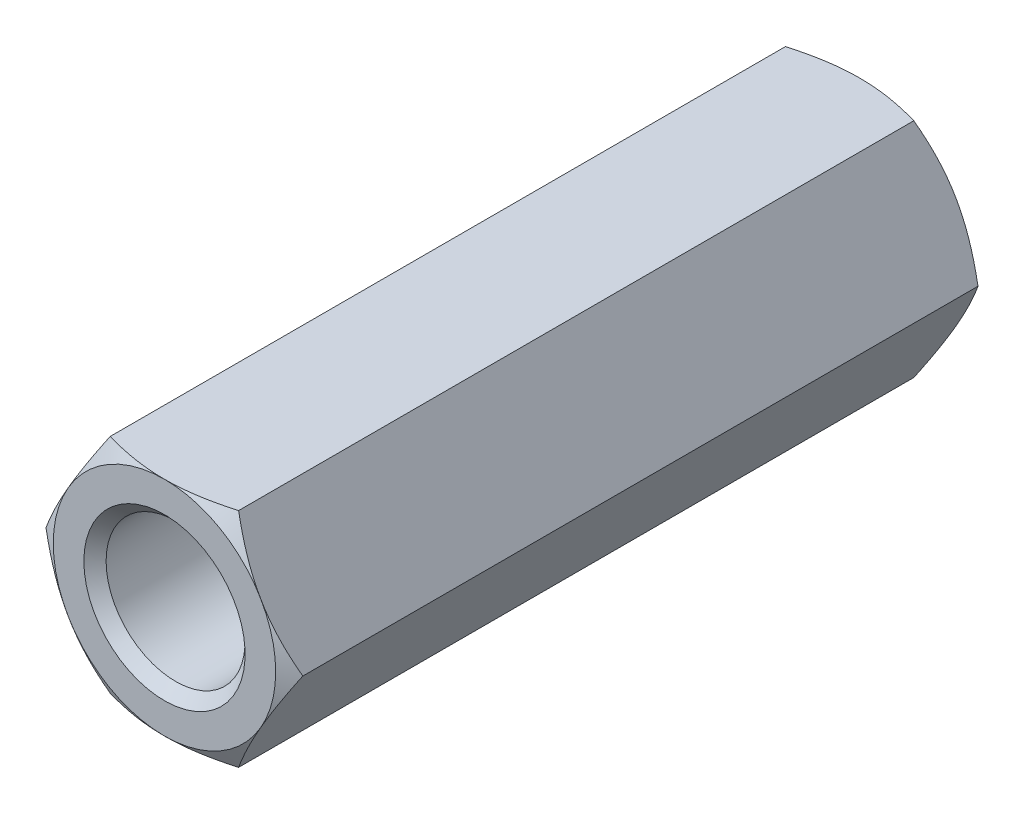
ISO-10303-21;
HEADER;
FILE_DESCRIPTION(('STEP AP214'),'2;1');
FILE_NAME('part.step','',(''),(''),'','','');
FILE_SCHEMA(('AUTOMOTIVE_DESIGN { 1 0 10303 214 1 1 1 1 }'));
ENDSEC;
DATA;
#1=APPLICATION_CONTEXT('core data for automotive mechanical design processes');
#2=APPLICATION_PROTOCOL_DEFINITION('international standard','automotive_design',2000,#1);
#3=PRODUCT_CONTEXT('',#1,'mechanical');
#4=PRODUCT('Part','Part','',(#3));
#5=PRODUCT_RELATED_PRODUCT_CATEGORY('part','',(#4));
#6=PRODUCT_DEFINITION_FORMATION('','',#4);
#7=PRODUCT_DEFINITION_CONTEXT('part definition',#1,'design');
#8=PRODUCT_DEFINITION('design','',#6,#7);
#9=PRODUCT_DEFINITION_SHAPE('','',#8);
#10=(LENGTH_UNIT() NAMED_UNIT(*) SI_UNIT(.MILLI.,.METRE.));
#11=(NAMED_UNIT(*) PLANE_ANGLE_UNIT() SI_UNIT($,.RADIAN.));
#12=(NAMED_UNIT(*) SI_UNIT($,.STERADIAN.) SOLID_ANGLE_UNIT());
#13=UNCERTAINTY_MEASURE_WITH_UNIT(LENGTH_MEASURE(1.E-05),#10,'distance_accuracy_value','');
#14=(GEOMETRIC_REPRESENTATION_CONTEXT(3) GLOBAL_UNCERTAINTY_ASSIGNED_CONTEXT((#13)) GLOBAL_UNIT_ASSIGNED_CONTEXT((#10,
#11,#12)) REPRESENTATION_CONTEXT('',''));
#15=CARTESIAN_POINT('',(0.,0.,0.));
#16=DIRECTION('',(0.,0.,1.));
#17=DIRECTION('',(1.,0.,0.));
#18=AXIS2_PLACEMENT_3D('',#15,#16,#17);
#19=CARTESIAN_POINT('',(4.61880215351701,0.,-12.5));
#20=DIRECTION('',(0.866025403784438,0.5,0.));
#21=DIRECTION('',(-0.5,0.866025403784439,0.));
#22=AXIS2_PLACEMENT_3D('',#19,#20,#21);
#23=PLANE('',#22);
#24=CARTESIAN_POINT('',(4.61891762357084,-0.000199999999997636,12.1426677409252));
#25=CARTESIAN_POINT('',(4.5174314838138,0.17557915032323,12.2012821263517));
#26=CARTESIAN_POINT('',(4.41506932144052,0.352875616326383,12.2545896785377));
#27=CARTESIAN_POINT('',(4.20857250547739,0.710538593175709,12.3476383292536));
#28=CARTESIAN_POINT('',(4.10443418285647,0.890911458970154,12.3873465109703));
#29=CARTESIAN_POINT('',(3.89744813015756,1.24942181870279,12.4491577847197));
#30=CARTESIAN_POINT('',(3.79463224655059,1.42750415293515,12.4716722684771));
#31=CARTESIAN_POINT('',(3.58851671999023,1.78450671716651,12.4985493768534));
#32=CARTESIAN_POINT('',(3.48521782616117,1.9634256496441,12.5029342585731));
#33=CARTESIAN_POINT('',(3.29219970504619,2.29774284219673,12.49380992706));
#34=CARTESIAN_POINT('',(3.20245157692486,2.45319115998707,12.482541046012));
#35=CARTESIAN_POINT('',(3.02354002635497,2.76307505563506,12.4468260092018));
#36=CARTESIAN_POINT('',(2.93437722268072,2.91750956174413,12.4223676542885));
#37=CARTESIAN_POINT('',(2.75509682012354,3.22803232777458,12.3612239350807));
#38=CARTESIAN_POINT('',(2.6650019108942,3.3840812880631,12.3242793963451));
#39=CARTESIAN_POINT('',(2.48615580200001,3.69385183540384,12.240429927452));
#40=CARTESIAN_POINT('',(2.39740231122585,3.84757739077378,12.1935446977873));
#41=CARTESIAN_POINT('',(2.30928560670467,4.0002,12.1426677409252));
#42=B_SPLINE_CURVE_WITH_KNOTS('',3,(#24,#25,#26,#27,#28,#29,#30,#31,#32,#33,#34,#35,#36,#37,#38,
#39,#40,#41),.UNSPECIFIED.,.F.,.F.,(4,2,2,2,2,2,2,2,4),(0.,0.634047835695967,1.26961969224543,
1.88946157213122,2.50854226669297,3.04757825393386,3.58711366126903,4.13861653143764,
4.68903648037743),.UNSPECIFIED.);
#43=CARTESIAN_POINT('',(4.61880215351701,0.,12.1427344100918));
#44=VERTEX_POINT('',#43);
#45=CARTESIAN_POINT('',(3.46410161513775,2.,12.5));
#46=VERTEX_POINT('',#45);
#47=EDGE_CURVE('E171',#44,#46,#42,.T.);
#48=ORIENTED_EDGE('',*,*,#47,.F.);
#49=DIRECTION('',(0.,0.,1.));
#50=VECTOR('',#49,1.);
#51=CARTESIAN_POINT('',(4.61880215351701,0.,-12.5));
#52=LINE('',#51,#50);
#53=CARTESIAN_POINT('',(4.61880215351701,0.,-12.1427344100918));
#54=VERTEX_POINT('',#53);
#55=EDGE_CURVE('E320',#54,#44,#52,.T.);
#56=ORIENTED_EDGE('',*,*,#55,.F.);
#57=CARTESIAN_POINT('',(4.61891762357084,-0.000199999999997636,-12.1426677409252));
#58=CARTESIAN_POINT('',(4.5174314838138,0.17557915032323,-12.2012821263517));
#59=CARTESIAN_POINT('',(4.41506932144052,0.352875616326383,-12.2545896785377));
#60=CARTESIAN_POINT('',(4.20857250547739,0.710538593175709,-12.3476383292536));
#61=CARTESIAN_POINT('',(4.10443418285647,0.890911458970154,-12.3873465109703));
#62=CARTESIAN_POINT('',(3.89744813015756,1.24942181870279,-12.4491577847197));
#63=CARTESIAN_POINT('',(3.79463224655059,1.42750415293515,-12.4716722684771));
#64=CARTESIAN_POINT('',(3.58851671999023,1.78450671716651,-12.4985493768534));
#65=CARTESIAN_POINT('',(3.48521782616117,1.9634256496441,-12.5029342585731));
#66=CARTESIAN_POINT('',(3.29219970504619,2.29774284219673,-12.49380992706));
#67=CARTESIAN_POINT('',(3.20245157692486,2.45319115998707,-12.482541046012));
#68=CARTESIAN_POINT('',(3.02354002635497,2.76307505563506,-12.4468260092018));
#69=CARTESIAN_POINT('',(2.93437722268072,2.91750956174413,-12.4223676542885));
#70=CARTESIAN_POINT('',(2.75509682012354,3.22803232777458,-12.3612239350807));
#71=CARTESIAN_POINT('',(2.6650019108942,3.3840812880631,-12.3242793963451));
#72=CARTESIAN_POINT('',(2.48615580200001,3.69385183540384,-12.240429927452));
#73=CARTESIAN_POINT('',(2.39740231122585,3.84757739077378,-12.1935446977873));
#74=CARTESIAN_POINT('',(2.30928560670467,4.0002,-12.1426677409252));
#75=B_SPLINE_CURVE_WITH_KNOTS('',3,(#57,#58,#59,#60,#61,#62,#63,#64,#65,#66,#67,#68,#69,#70,#71,
#72,#73,#74),.UNSPECIFIED.,.F.,.F.,(4,2,2,2,2,2,2,2,4),(0.,0.634047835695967,1.26961969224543,
1.88946157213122,2.50854226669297,3.04757825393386,3.58711366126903,4.13861653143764,
4.68903648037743),.UNSPECIFIED.);
#76=CARTESIAN_POINT('',(3.46410161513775,2.,-12.5));
#77=VERTEX_POINT('',#76);
#78=EDGE_CURVE('E305',#54,#77,#75,.T.);
#79=ORIENTED_EDGE('',*,*,#78,.T.);
#80=CARTESIAN_POINT('',(2.3094010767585,4.,-12.1427344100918));
#81=VERTEX_POINT('',#80);
#82=EDGE_CURVE('E252',#77,#81,#75,.T.);
#83=ORIENTED_EDGE('',*,*,#82,.T.);
#84=DIRECTION('',(0.,0.,1.));
#85=VECTOR('',#84,1.);
#86=CARTESIAN_POINT('',(2.3094010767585,4.,-12.5));
#87=LINE('',#86,#85);
#88=CARTESIAN_POINT('',(2.3094010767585,4.,12.1427344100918));
#89=VERTEX_POINT('',#88);
#90=EDGE_CURVE('E350',#81,#89,#87,.T.);
#91=ORIENTED_EDGE('',*,*,#90,.T.);
#92=EDGE_CURVE('E147',#46,#89,#42,.T.);
#93=ORIENTED_EDGE('',*,*,#92,.F.);
#94=EDGE_LOOP('',(#48,#56,#79,#83,#91,#93));
#95=FACE_BOUND('',#94,.T.);
#96=ADVANCED_FACE('F41',(#95),#23,.T.);
#97=CARTESIAN_POINT('',(2.3094010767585,-4.,-12.5));
#98=DIRECTION('',(0.866025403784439,-0.5,0.));
#99=DIRECTION('',(0.5,0.866025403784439,0.));
#100=AXIS2_PLACEMENT_3D('',#97,#98,#99);
#101=PLANE('',#100);
#102=CARTESIAN_POINT('',(2.30928560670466,-4.0002,12.1426677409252));
#103=CARTESIAN_POINT('',(2.4107717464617,-3.82442084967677,12.2012821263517));
#104=CARTESIAN_POINT('',(2.51313390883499,-3.64712438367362,12.2545896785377));
#105=CARTESIAN_POINT('',(2.71963072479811,-3.28946140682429,12.3476383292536));
#106=CARTESIAN_POINT('',(2.82376904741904,-3.10908854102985,12.3873465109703));
#107=CARTESIAN_POINT('',(3.03075510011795,-2.75057818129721,12.4491577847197));
#108=CARTESIAN_POINT('',(3.13357098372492,-2.57249584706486,12.4716722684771));
#109=CARTESIAN_POINT('',(3.33968651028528,-2.21549328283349,12.4985493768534));
#110=CARTESIAN_POINT('',(3.44298540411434,-2.0365743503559,12.5029342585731));
#111=CARTESIAN_POINT('',(3.63600352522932,-1.70225715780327,12.49380992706));
#112=CARTESIAN_POINT('',(3.72575165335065,-1.54680884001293,12.482541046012));
#113=CARTESIAN_POINT('',(3.90466320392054,-1.23692494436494,12.4468260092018));
#114=CARTESIAN_POINT('',(3.99382600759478,-1.08249043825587,12.4223676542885));
#115=CARTESIAN_POINT('',(4.17310641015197,-0.771967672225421,12.3612239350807));
#116=CARTESIAN_POINT('',(4.26320131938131,-0.615918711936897,12.3242793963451));
#117=CARTESIAN_POINT('',(4.4420474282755,-0.306148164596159,12.240429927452));
#118=CARTESIAN_POINT('',(4.53080091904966,-0.152422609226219,12.1935446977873));
#119=CARTESIAN_POINT('',(4.61891762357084,0.000200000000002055,12.1426677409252));
#120=B_SPLINE_CURVE_WITH_KNOTS('',3,(#102,#103,#104,#105,#106,#107,#108,#109,#110,#111,#112,
#113,#114,#115,#116,#117,#118,#119),.UNSPECIFIED.,.F.,.F.,(4,2,2,2,2,2,2,2,4),(0.,
0.634047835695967,1.26961969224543,1.88946157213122,2.50854226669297,3.04757825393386,
3.58711366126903,4.13861653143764,4.68903648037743),.UNSPECIFIED.);
#121=CARTESIAN_POINT('',(2.3094010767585,-4.,12.1427344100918));
#122=VERTEX_POINT('',#121);
#123=CARTESIAN_POINT('',(3.46410161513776,-2.,12.5));
#124=VERTEX_POINT('',#123);
#125=EDGE_CURVE('E416',#122,#124,#120,.T.);
#126=ORIENTED_EDGE('',*,*,#125,.F.);
#127=DIRECTION('',(0.,0.,1.));
#128=VECTOR('',#127,1.);
#129=CARTESIAN_POINT('',(2.3094010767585,-4.,-12.5));
#130=LINE('',#129,#128);
#131=CARTESIAN_POINT('',(2.3094010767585,-4.,-12.1427344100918));
#132=VERTEX_POINT('',#131);
#133=EDGE_CURVE('E421',#132,#122,#130,.T.);
#134=ORIENTED_EDGE('',*,*,#133,.F.);
#135=CARTESIAN_POINT('',(2.30928560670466,-4.0002,-12.1426677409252));
#136=CARTESIAN_POINT('',(2.4107717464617,-3.82442084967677,-12.2012821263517));
#137=CARTESIAN_POINT('',(2.51313390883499,-3.64712438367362,-12.2545896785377));
#138=CARTESIAN_POINT('',(2.71963072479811,-3.28946140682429,-12.3476383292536));
#139=CARTESIAN_POINT('',(2.82376904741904,-3.10908854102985,-12.3873465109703));
#140=CARTESIAN_POINT('',(3.03075510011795,-2.75057818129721,-12.4491577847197));
#141=CARTESIAN_POINT('',(3.13357098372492,-2.57249584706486,-12.4716722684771));
#142=CARTESIAN_POINT('',(3.33968651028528,-2.21549328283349,-12.4985493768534));
#143=CARTESIAN_POINT('',(3.44298540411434,-2.0365743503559,-12.5029342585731));
#144=CARTESIAN_POINT('',(3.63600352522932,-1.70225715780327,-12.49380992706));
#145=CARTESIAN_POINT('',(3.72575165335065,-1.54680884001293,-12.482541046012));
#146=CARTESIAN_POINT('',(3.90466320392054,-1.23692494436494,-12.4468260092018));
#147=CARTESIAN_POINT('',(3.99382600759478,-1.08249043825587,-12.4223676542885));
#148=CARTESIAN_POINT('',(4.17310641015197,-0.771967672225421,-12.3612239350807));
#149=CARTESIAN_POINT('',(4.26320131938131,-0.615918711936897,-12.3242793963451));
#150=CARTESIAN_POINT('',(4.4420474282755,-0.306148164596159,-12.240429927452));
#151=CARTESIAN_POINT('',(4.53080091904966,-0.152422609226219,-12.1935446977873));
#152=CARTESIAN_POINT('',(4.61891762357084,0.000200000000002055,-12.1426677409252));
#153=B_SPLINE_CURVE_WITH_KNOTS('',3,(#135,#136,#137,#138,#139,#140,#141,#142,#143,#144,#145,
#146,#147,#148,#149,#150,#151,#152),.UNSPECIFIED.,.F.,.F.,(4,2,2,2,2,2,2,2,4),(0.,
0.634047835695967,1.26961969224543,1.88946157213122,2.50854226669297,3.04757825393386,
3.58711366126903,4.13861653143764,4.68903648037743),.UNSPECIFIED.);
#154=CARTESIAN_POINT('',(3.46410161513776,-2.,-12.5));
#155=VERTEX_POINT('',#154);
#156=EDGE_CURVE('E335',#132,#155,#153,.T.);
#157=ORIENTED_EDGE('',*,*,#156,.T.);
#158=EDGE_CURVE('E249',#155,#54,#153,.T.);
#159=ORIENTED_EDGE('',*,*,#158,.T.);
#160=ORIENTED_EDGE('',*,*,#55,.T.);
#161=EDGE_CURVE('E175',#124,#44,#120,.T.);
#162=ORIENTED_EDGE('',*,*,#161,.F.);
#163=EDGE_LOOP('',(#126,#134,#157,#159,#160,#162));
#164=FACE_BOUND('',#163,.T.);
#165=ADVANCED_FACE('F332',(#164),#101,.T.);
#166=CARTESIAN_POINT('',(-2.3094010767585,-4.,-12.5));
#167=DIRECTION('',(0.,-1.,0.));
#168=DIRECTION('',(0.,0.,-1.));
#169=AXIS2_PLACEMENT_3D('',#166,#167,#168);
#170=PLANE('',#169);
#171=CARTESIAN_POINT('',(-21.1510594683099,-4.,2.38137741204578));
#172=CARTESIAN_POINT('',(-20.6942179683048,-4.,2.64053442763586));
#173=CARTESIAN_POINT('',(-20.2372574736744,-4.,2.89948200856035));
#174=CARTESIAN_POINT('',(-19.323032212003,-4.,3.41684159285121));
#175=CARTESIAN_POINT('',(-18.8657674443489,-4.,3.67525359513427));
#176=CARTESIAN_POINT('',(-17.9508132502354,-4.,4.19145583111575));
#177=CARTESIAN_POINT('',(-17.4931237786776,-4.,4.44924598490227));
#178=CARTESIAN_POINT('',(-16.57728444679,-4.,4.96400646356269));
#179=CARTESIAN_POINT('',(-16.1191345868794,-4.,5.22097678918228));
#180=CARTESIAN_POINT('',(-15.2055885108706,-4.,5.73200743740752));
#181=CARTESIAN_POINT('',(-14.7501965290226,-4.,5.98607532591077));
#182=CARTESIAN_POINT('',(-13.8386710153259,-4.,6.49287708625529));
#183=CARTESIAN_POINT('',(-13.3825374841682,-4.,6.74561095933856));
#184=CARTESIAN_POINT('',(-12.4693270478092,-4.,7.2492896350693));
#185=CARTESIAN_POINT('',(-12.0122502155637,-4.,7.50023456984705));
#186=CARTESIAN_POINT('',(-11.0967768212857,-4.,7.99970159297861));
#187=CARTESIAN_POINT('',(-10.638380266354,-4.,8.248223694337));
#188=CARTESIAN_POINT('',(-9.71256173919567,-4.,8.74572431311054));
#189=CARTESIAN_POINT('',(-9.24511079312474,-4.,8.99464910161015));
#190=CARTESIAN_POINT('',(-8.54182858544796,-4.,9.36411270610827));
#191=CARTESIAN_POINT('',(-8.30703298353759,-4.,9.4866221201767));
#192=CARTESIAN_POINT('',(-7.83658945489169,-4.,9.72999203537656));
#193=CARTESIAN_POINT('',(-7.60094153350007,-4.,9.85085254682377));
#194=CARTESIAN_POINT('',(-7.12715586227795,-4.,10.0912274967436));
#195=CARTESIAN_POINT('',(-6.88901168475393,-4.,10.2107292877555));
#196=CARTESIAN_POINT('',(-6.41138998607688,-4.,10.4470334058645));
#197=CARTESIAN_POINT('',(-6.17191248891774,-4.,10.5638357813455));
#198=CARTESIAN_POINT('',(-5.69131115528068,-4.,10.7938914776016));
#199=CARTESIAN_POINT('',(-5.45018765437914,-4.,10.9071454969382));
#200=CARTESIAN_POINT('',(-4.96579109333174,-4.,11.1289435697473));
#201=CARTESIAN_POINT('',(-4.7225181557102,-4.,11.2374878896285));
#202=CARTESIAN_POINT('',(-4.2141833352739,-4.,11.4563723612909));
#203=CARTESIAN_POINT('',(-3.94889735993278,-4.,11.5661965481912));
#204=CARTESIAN_POINT('',(-3.41406734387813,-4.,11.7753118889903));
#205=CARTESIAN_POINT('',(-3.1445221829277,-4.,11.8746002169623));
#206=CARTESIAN_POINT('',(-2.60275727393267,-4.,12.0570463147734));
#207=CARTESIAN_POINT('',(-2.33058677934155,-4.,12.1403474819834));
#208=CARTESIAN_POINT('',(-1.7805348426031,-4.,12.2854683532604));
#209=CARTESIAN_POINT('',(-1.50265683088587,-4.,12.3473005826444));
#210=CARTESIAN_POINT('',(-1.00251478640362,-4.,12.4316526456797));
#211=CARTESIAN_POINT('',(-0.781228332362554,-4.,12.4597840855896));
#212=CARTESIAN_POINT('',(-0.448122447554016,-4.,12.4864255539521));
#213=CARTESIAN_POINT('',(-0.336896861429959,-4.,12.4927135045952));
#214=CARTESIAN_POINT('',(-0.114264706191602,-4.,12.4999474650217));
#215=CARTESIAN_POINT('',(-0.00285813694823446,-4.,12.5008934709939));
#216=CARTESIAN_POINT('',(0.220307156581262,-4.,12.4974006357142));
#217=CARTESIAN_POINT('',(0.332065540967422,-4.,12.492940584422));
#218=CARTESIAN_POINT('',(0.555246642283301,-4.,12.4787361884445));
#219=CARTESIAN_POINT('',(0.666669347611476,-4.,12.4689916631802));
#220=CARTESIAN_POINT('',(0.888971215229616,-4.,12.4444937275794));
#221=CARTESIAN_POINT('',(0.999850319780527,-4.,12.4297397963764));
#222=CARTESIAN_POINT('',(1.22088008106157,-4.,12.3956069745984));
#223=CARTESIAN_POINT('',(1.33103075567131,-4.,12.3762281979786));
#224=CARTESIAN_POINT('',(1.74768338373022,-4.,12.2947111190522));
#225=CARTESIAN_POINT('',(2.05144833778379,-4.,12.2182959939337));
#226=CARTESIAN_POINT('',(2.50193014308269,-4.,12.086481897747));
#227=CARTESIAN_POINT('',(2.65133426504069,-4.,12.0396391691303));
#228=CARTESIAN_POINT('',(2.9485840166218,-4.,11.9412235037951));
#229=CARTESIAN_POINT('',(3.09642975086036,-4.,11.8896508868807));
#230=CARTESIAN_POINT('',(3.39131226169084,-4.,11.7824211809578));
#231=CARTESIAN_POINT('',(3.53834313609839,-4.,11.7267480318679));
#232=CARTESIAN_POINT('',(3.8311576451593,-4.,11.6122042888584));
#233=CARTESIAN_POINT('',(3.97694122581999,-4.,11.5533335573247));
#234=CARTESIAN_POINT('',(4.41250538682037,-4.,11.3728754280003));
#235=CARTESIAN_POINT('',(4.70066495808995,-4.,11.2473803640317));
#236=CARTESIAN_POINT('',(5.28053302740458,-4.,10.9862045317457));
#237=CARTESIAN_POINT('',(5.57216361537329,-4.,10.8503527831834));
#238=CARTESIAN_POINT('',(6.1529317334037,-4.,10.5733723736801));
#239=CARTESIAN_POINT('',(6.44206903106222,-4.,10.4322432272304));
#240=CARTESIAN_POINT('',(7.01767741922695,-4.,10.1465594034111));
#241=CARTESIAN_POINT('',(7.30415356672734,-4.,10.0020148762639));
#242=CARTESIAN_POINT('',(7.87566817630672,-4.,9.71010622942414));
#243=CARTESIAN_POINT('',(8.16070661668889,-4.,9.56274206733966));
#244=CARTESIAN_POINT('',(8.72206499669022,-4.,9.26983482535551));
#245=CARTESIAN_POINT('',(8.99841445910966,-4.,9.12434823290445));
#246=CARTESIAN_POINT('',(9.55026988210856,-4.,8.83178283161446));
#247=CARTESIAN_POINT('',(9.82577583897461,-4.,8.6847040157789));
#248=CARTESIAN_POINT('',(10.6512963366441,-4.,8.24158146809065));
#249=CARTESIAN_POINT('',(11.2003014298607,-4.,7.94365797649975));
#250=CARTESIAN_POINT('',(12.297085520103,-4.,7.34420801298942));
#251=CARTESIAN_POINT('',(12.8448626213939,-4.,7.04267808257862));
#252=CARTESIAN_POINT('',(13.9391380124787,-4.,6.43732310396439));
#253=CARTESIAN_POINT('',(14.4856363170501,-4.,6.13349808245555));
#254=CARTESIAN_POINT('',(15.5430948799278,-4.,5.54350362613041));
#255=CARTESIAN_POINT('',(16.0541119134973,-4.,5.25743585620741));
#256=CARTESIAN_POINT('',(17.0755285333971,-4.,4.68419614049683));
#257=CARTESIAN_POINT('',(17.5859281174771,-4.,4.39702419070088));
#258=CARTESIAN_POINT('',(18.6056675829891,-4.,3.82215491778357));
#259=CARTESIAN_POINT('',(19.1150080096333,-4.,3.53445856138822));
#260=CARTESIAN_POINT('',(20.1333006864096,-4.,2.95838605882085));
#261=CARTESIAN_POINT('',(20.6422529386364,-4.,2.6700099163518));
#262=CARTESIAN_POINT('',(21.1510594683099,-4.,2.38137741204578));
#263=B_SPLINE_CURVE_WITH_KNOTS('',3,(#171,#172,#173,#174,#175,#176,#177,#178,#179,#180,#181,
#182,#183,#184,#185,#186,#187,#188,#189,#190,#191,#192,#193,#194,#195,#196,#197,#198,#199,#200,
#201,#202,#203,#204,#205,#206,#207,#208,#209,#210,#211,#212,#213,#214,#215,#216,#217,#218,#219,
#220,#221,#222,#223,#224,#225,#226,#227,#228,#229,#230,#231,#232,#233,#234,#235,#236,#237,#238,
#239,#240,#241,#242,#243,#244,#245,#246,#247,#248,#249,#250,#251,#252,#253,#254,#255,#256,#257,
#258,#259,#260,#261,#262),.UNSPECIFIED.,.F.,.F.,(4,2,2,2,2,2,2,2,2,2,2,2,2,2,2,2,2,2,2,2,2,2,2,
2,2,2,2,2,2,2,2,2,2,2,2,2,2,2,2,2,2,2,2,2,2,4),(0.,1.57569007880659,3.15138334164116,
4.72726932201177,6.30315386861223,7.86756614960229,9.43197697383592,10.9962710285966,
12.5605566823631,14.1493240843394,14.94382390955,15.7383187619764,16.5376428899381,
17.3369526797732,18.1361041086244,18.9352102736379,19.7964169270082,20.6578539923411,
21.511160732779,22.3639688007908,23.0322330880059,23.3663309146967,23.7004289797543,
24.0358420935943,24.3712666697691,24.7067261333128,25.04217733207,25.9802336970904,
26.4499307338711,26.9195960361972,27.3912101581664,27.8628445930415,28.8055837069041,
29.7706809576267,30.7358672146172,31.6984768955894,32.661101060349,33.5980142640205,
34.5349315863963,36.4088071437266,38.2846526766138,40.1604764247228,41.9173921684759,
43.6743142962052,45.4292415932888,47.184159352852),.UNSPECIFIED.);
#264=CARTESIAN_POINT('',(-2.3094010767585,-4.,12.1427344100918));
#265=VERTEX_POINT('',#264);
#266=CARTESIAN_POINT('',(0.,-4.,12.5));
#267=VERTEX_POINT('',#266);
#268=EDGE_CURVE('E386',#265,#267,#263,.T.);
#269=ORIENTED_EDGE('',*,*,#268,.F.);
#270=DIRECTION('',(0.,0.,1.));
#271=VECTOR('',#270,1.);
#272=CARTESIAN_POINT('',(-2.3094010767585,-4.,-12.5));
#273=LINE('',#272,#271);
#274=CARTESIAN_POINT('',(-2.3094010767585,-4.,-12.1427344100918));
#275=VERTEX_POINT('',#274);
#276=EDGE_CURVE('E422',#275,#265,#273,.T.);
#277=ORIENTED_EDGE('',*,*,#276,.F.);
#278=CARTESIAN_POINT('',(-12.9524972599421,-4.,-6.98279718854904));
#279=CARTESIAN_POINT('',(-12.6665308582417,-4.,-7.1405388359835));
#280=CARTESIAN_POINT('',(-12.3803796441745,-4.,-7.29794673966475));
#281=CARTESIAN_POINT('',(-11.8076085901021,-4.,-7.61191510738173));
#282=CARTESIAN_POINT('',(-11.5209887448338,-4.,-7.76847556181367));
#283=CARTESIAN_POINT('',(-10.9470487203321,-4.,-8.08064119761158));
#284=CARTESIAN_POINT('',(-10.659728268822,-4.,-8.23624587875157));
#285=CARTESIAN_POINT('',(-10.0843947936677,-4.,-8.54616735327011));
#286=CARTESIAN_POINT('',(-9.79638177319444,-4.,-8.70048415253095));
#287=CARTESIAN_POINT('',(-9.21477013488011,-4.,-9.01000307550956));
#288=CARTESIAN_POINT('',(-8.92115722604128,-4.,-9.16517837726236));
#289=CARTESIAN_POINT('',(-8.33279386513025,-4.,-9.47335619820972));
#290=CARTESIAN_POINT('',(-8.03804341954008,-4.,-9.62635872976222));
#291=CARTESIAN_POINT('',(-7.44713207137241,-4.,-9.92946407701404));
#292=CARTESIAN_POINT('',(-7.15097148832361,-4.,-10.0795675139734));
#293=CARTESIAN_POINT('',(-6.55671816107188,-4.,-10.3758881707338));
#294=CARTESIAN_POINT('',(-6.25862546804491,-4.,-10.5221054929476));
#295=CARTESIAN_POINT('',(-5.65489094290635,-4.,-10.8115319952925));
#296=CARTESIAN_POINT('',(-5.34920576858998,-4.,-10.9546515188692));
#297=CARTESIAN_POINT('',(-4.88789347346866,-4.,-11.1632864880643));
#298=CARTESIAN_POINT('',(-4.73363787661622,-4.,-11.2318328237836));
#299=CARTESIAN_POINT('',(-4.42404202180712,-4.,-11.3664493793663));
#300=CARTESIAN_POINT('',(-4.26870173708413,-4.,-11.4325195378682));
#301=CARTESIAN_POINT('',(-3.95709486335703,-4.,-11.5614875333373));
#302=CARTESIAN_POINT('',(-3.8008309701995,-4.,-11.624391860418));
#303=CARTESIAN_POINT('',(-3.48685375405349,-4.,-11.7464680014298));
#304=CARTESIAN_POINT('',(-3.32914049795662,-4.,-11.8056399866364));
#305=CARTESIAN_POINT('',(-3.01211328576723,-4.,-11.9193377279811));
#306=CARTESIAN_POINT('',(-2.85280005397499,-4.,-11.9738654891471));
#307=CARTESIAN_POINT('',(-2.5322649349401,-4.,-12.0772044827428));
#308=CARTESIAN_POINT('',(-2.37104245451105,-4.,-12.1260138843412));
#309=CARTESIAN_POINT('',(-1.98888314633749,-4.,-12.2326747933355));
#310=CARTESIAN_POINT('',(-1.76710241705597,-4.,-12.2875679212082));
#311=CARTESIAN_POINT('',(-1.32004221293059,-4.,-12.3804611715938));
#312=CARTESIAN_POINT('',(-1.09476499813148,-4.,-12.4184717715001));
#313=CARTESIAN_POINT('',(-0.755759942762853,-4.,-12.4600018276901));
#314=CARTESIAN_POINT('',(-0.642955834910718,-4.,-12.4712521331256));
#315=CARTESIAN_POINT('',(-0.416946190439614,-4.,-12.4883872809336));
#316=CARTESIAN_POINT('',(-0.303740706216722,-4.,-12.4942727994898));
#317=CARTESIAN_POINT('',(-0.07717460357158,-4.,-12.500494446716));
#318=CARTESIAN_POINT('',(0.0361860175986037,-4.,-12.5008304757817));
#319=CARTESIAN_POINT('',(0.262776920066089,-4.,-12.4959454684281));
#320=CARTESIAN_POINT('',(0.376007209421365,-4.,-12.4907247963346));
#321=CARTESIAN_POINT('',(0.627561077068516,-4.,-12.4730973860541));
#322=CARTESIAN_POINT('',(0.765791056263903,-4.,-12.4593367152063));
#323=CARTESIAN_POINT('',(1.04128371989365,-4.,-12.4242949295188));
#324=CARTESIAN_POINT('',(1.17854631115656,-4.,-12.4030131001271));
#325=CARTESIAN_POINT('',(1.58868174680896,-4.,-12.3290493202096));
#326=CARTESIAN_POINT('',(1.85975908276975,-4.,-12.2662605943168));
#327=CARTESIAN_POINT('',(2.26504733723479,-4.,-12.1563673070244));
#328=CARTESIAN_POINT('',(2.40137525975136,-4.,-12.1166038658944));
#329=CARTESIAN_POINT('',(2.672691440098,-4.,-12.032702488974));
#330=CARTESIAN_POINT('',(2.80767969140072,-4.,-11.9885645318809));
#331=CARTESIAN_POINT('',(3.07635636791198,-4.,-11.8966558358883));
#332=CARTESIAN_POINT('',(3.210045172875,-4.,-11.848886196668));
#333=CARTESIAN_POINT('',(3.47629056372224,-4.,-11.7503067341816));
#334=CARTESIAN_POINT('',(3.60884717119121,-4.,-11.6994969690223));
#335=CARTESIAN_POINT('',(3.951518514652,-4.,-11.5643649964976));
#336=CARTESIAN_POINT('',(4.16086128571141,-4.,-11.4780876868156));
#337=CARTESIAN_POINT('',(4.57748286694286,-4.,-11.3006691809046));
#338=CARTESIAN_POINT('',(4.78476147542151,-4.,-11.2095275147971));
#339=CARTESIAN_POINT('',(5.1976980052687,-4.,-11.0234888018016));
#340=CARTESIAN_POINT('',(5.40335540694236,-4.,-10.9285906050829));
#341=CARTESIAN_POINT('',(5.8133091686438,-4.,-10.7358927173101));
#342=CARTESIAN_POINT('',(6.01760548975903,-4.,-10.6380929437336));
#343=CARTESIAN_POINT('',(6.42537951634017,-4.,-10.4400637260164));
#344=CARTESIAN_POINT('',(6.62885561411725,-4.,-10.3398309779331));
#345=CARTESIAN_POINT('',(7.03489264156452,-4.,-10.1375267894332));
#346=CARTESIAN_POINT('',(7.23745356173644,-4.,-10.0354553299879));
#347=CARTESIAN_POINT('',(7.84392876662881,-4.,-9.72706774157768));
#348=CARTESIAN_POINT('',(8.24671719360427,-4.,-9.51853835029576));
#349=CARTESIAN_POINT('',(9.01011526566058,-4.,-9.11849196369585));
#350=CARTESIAN_POINT('',(9.37092404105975,-4.,-8.92735314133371));
#351=CARTESIAN_POINT('',(10.0912874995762,-4.,-8.54268120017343));
#352=CARTESIAN_POINT('',(10.4508421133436,-4.,-8.34914795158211));
#353=CARTESIAN_POINT('',(11.1678504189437,-4.,-7.96091187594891));
#354=CARTESIAN_POINT('',(11.5253071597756,-4.,-7.76621467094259));
#355=CARTESIAN_POINT('',(12.2394347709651,-4.,-7.37544505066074));
#356=CARTESIAN_POINT('',(12.5961056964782,-4.,-7.17937273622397));
#357=CARTESIAN_POINT('',(12.9524972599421,-4.,-6.98279718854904));
#358=B_SPLINE_CURVE_WITH_KNOTS('',3,(#278,#279,#280,#281,#282,#283,#284,#285,#286,#287,#288,
#289,#290,#291,#292,#293,#294,#295,#296,#297,#298,#299,#300,#301,#302,#303,#304,#305,#306,#307,
#308,#309,#310,#311,#312,#313,#314,#315,#316,#317,#318,#319,#320,#321,#322,#323,#324,#325,#326,
#327,#328,#329,#330,#331,#332,#333,#334,#335,#336,#337,#338,#339,#340,#341,#342,#343,#344,#345,
#346,#347,#348,#349,#350,#351,#352,#353,#354,#355,#356,#357),.UNSPECIFIED.,.F.,.F.,(4,2,2,2,2,2,
2,2,2,2,2,2,2,2,2,2,2,2,2,2,2,2,2,2,2,2,2,2,2,2,2,2,2,2,2,2,2,2,2,4),(0.,0.979762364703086,
1.95953580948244,2.9397845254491,3.92002876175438,4.91631051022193,5.9125865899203,
6.90864674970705,7.90468063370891,8.91717634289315,9.42355918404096,9.92995456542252,
10.435265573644,10.940553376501,11.4456219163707,11.9508517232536,12.6357754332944,
13.3202734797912,13.6602555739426,14.0001948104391,14.340140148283,14.6800631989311,
15.0965648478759,15.5131060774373,16.3466174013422,16.7726041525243,17.198592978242,
17.624453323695,18.0503055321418,18.7294903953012,19.4087409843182,20.0882011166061,
20.7676805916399,21.4481410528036,22.1286085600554,23.4892706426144,24.7141912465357,
25.9391785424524,27.1602981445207,28.3813291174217),.UNSPECIFIED.);
#359=CARTESIAN_POINT('',(0.,-4.,-12.5));
#360=VERTEX_POINT('',#359);
#361=EDGE_CURVE('E344',#275,#360,#358,.T.);
#362=ORIENTED_EDGE('',*,*,#361,.T.);
#363=EDGE_CURVE('E277',#360,#132,#358,.T.);
#364=ORIENTED_EDGE('',*,*,#363,.T.);
#365=ORIENTED_EDGE('',*,*,#133,.T.);
#366=EDGE_CURVE('E211',#267,#122,#263,.T.);
#367=ORIENTED_EDGE('',*,*,#366,.F.);
#368=EDGE_LOOP('',(#269,#277,#362,#364,#365,#367));
#369=FACE_BOUND('',#368,.T.);
#370=ADVANCED_FACE('F234',(#369),#170,.T.);
#371=CARTESIAN_POINT('',(-4.61880215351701,0.,-12.5));
#372=DIRECTION('',(-0.866025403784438,-0.5,0.));
#373=DIRECTION('',(0.5,-0.866025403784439,0.));
#374=AXIS2_PLACEMENT_3D('',#371,#372,#373);
#375=PLANE('',#374);
#376=CARTESIAN_POINT('',(-4.61891762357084,0.000199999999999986,12.1426677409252));
#377=CARTESIAN_POINT('',(-4.5174314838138,-0.175579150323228,12.2012821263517));
#378=CARTESIAN_POINT('',(-4.41506932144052,-0.352875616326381,12.2545896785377));
#379=CARTESIAN_POINT('',(-4.20857250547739,-0.710538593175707,12.3476383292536));
#380=CARTESIAN_POINT('',(-4.10443418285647,-0.890911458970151,12.3873465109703));
#381=CARTESIAN_POINT('',(-3.89744813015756,-1.24942181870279,12.4491577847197));
#382=CARTESIAN_POINT('',(-3.79463224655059,-1.42750415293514,12.4716722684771));
#383=CARTESIAN_POINT('',(-3.58851671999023,-1.78450671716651,12.4985493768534));
#384=CARTESIAN_POINT('',(-3.48521782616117,-1.9634256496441,12.5029342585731));
#385=CARTESIAN_POINT('',(-3.29219970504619,-2.29774284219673,12.49380992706));
#386=CARTESIAN_POINT('',(-3.20245157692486,-2.45319115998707,12.482541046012));
#387=CARTESIAN_POINT('',(-3.02354002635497,-2.76307505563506,12.4468260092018));
#388=CARTESIAN_POINT('',(-2.93437722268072,-2.91750956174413,12.4223676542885));
#389=CARTESIAN_POINT('',(-2.75509682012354,-3.22803232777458,12.3612239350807));
#390=CARTESIAN_POINT('',(-2.6650019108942,-3.3840812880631,12.3242793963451));
#391=CARTESIAN_POINT('',(-2.48615580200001,-3.69385183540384,12.240429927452));
#392=CARTESIAN_POINT('',(-2.39740231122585,-3.84757739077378,12.1935446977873));
#393=CARTESIAN_POINT('',(-2.30928560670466,-4.0002,12.1426677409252));
#394=B_SPLINE_CURVE_WITH_KNOTS('',3,(#376,#377,#378,#379,#380,#381,#382,#383,#384,#385,#386,
#387,#388,#389,#390,#391,#392,#393),.UNSPECIFIED.,.F.,.F.,(4,2,2,2,2,2,2,2,4),(0.,
0.634047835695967,1.26961969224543,1.88946157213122,2.50854226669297,3.04757825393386,
3.58711366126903,4.13861653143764,4.68903648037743),.UNSPECIFIED.);
#395=CARTESIAN_POINT('',(-4.61880215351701,0.,12.1427344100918));
#396=VERTEX_POINT('',#395);
#397=CARTESIAN_POINT('',(-3.46410161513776,-2.,12.5));
#398=VERTEX_POINT('',#397);
#399=EDGE_CURVE('E156',#396,#398,#394,.T.);
#400=ORIENTED_EDGE('',*,*,#399,.F.);
#401=DIRECTION('',(0.,0.,1.));
#402=VECTOR('',#401,1.);
#403=CARTESIAN_POINT('',(-4.61880215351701,0.,-12.5));
#404=LINE('',#403,#402);
#405=CARTESIAN_POINT('',(-4.61880215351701,0.,-12.1427344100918));
#406=VERTEX_POINT('',#405);
#407=EDGE_CURVE('E169',#406,#396,#404,.T.);
#408=ORIENTED_EDGE('',*,*,#407,.F.);
#409=CARTESIAN_POINT('',(-4.61891762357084,0.000199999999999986,-12.1426677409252));
#410=CARTESIAN_POINT('',(-4.5174314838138,-0.175579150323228,-12.2012821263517));
#411=CARTESIAN_POINT('',(-4.41506932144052,-0.352875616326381,-12.2545896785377));
#412=CARTESIAN_POINT('',(-4.20857250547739,-0.710538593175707,-12.3476383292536));
#413=CARTESIAN_POINT('',(-4.10443418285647,-0.890911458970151,-12.3873465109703));
#414=CARTESIAN_POINT('',(-3.89744813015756,-1.24942181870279,-12.4491577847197));
#415=CARTESIAN_POINT('',(-3.79463224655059,-1.42750415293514,-12.4716722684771));
#416=CARTESIAN_POINT('',(-3.58851671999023,-1.78450671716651,-12.4985493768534));
#417=CARTESIAN_POINT('',(-3.48521782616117,-1.9634256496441,-12.5029342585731));
#418=CARTESIAN_POINT('',(-3.29219970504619,-2.29774284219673,-12.49380992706));
#419=CARTESIAN_POINT('',(-3.20245157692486,-2.45319115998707,-12.482541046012));
#420=CARTESIAN_POINT('',(-3.02354002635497,-2.76307505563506,-12.4468260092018));
#421=CARTESIAN_POINT('',(-2.93437722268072,-2.91750956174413,-12.4223676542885));
#422=CARTESIAN_POINT('',(-2.75509682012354,-3.22803232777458,-12.3612239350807));
#423=CARTESIAN_POINT('',(-2.6650019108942,-3.3840812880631,-12.3242793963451));
#424=CARTESIAN_POINT('',(-2.48615580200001,-3.69385183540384,-12.240429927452));
#425=CARTESIAN_POINT('',(-2.39740231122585,-3.84757739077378,-12.1935446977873));
#426=CARTESIAN_POINT('',(-2.30928560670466,-4.0002,-12.1426677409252));
#427=B_SPLINE_CURVE_WITH_KNOTS('',3,(#409,#410,#411,#412,#413,#414,#415,#416,#417,#418,#419,
#420,#421,#422,#423,#424,#425,#426),.UNSPECIFIED.,.F.,.F.,(4,2,2,2,2,2,2,2,4),(0.,
0.634047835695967,1.26961969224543,1.88946157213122,2.50854226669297,3.04757825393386,
3.58711366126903,4.13861653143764,4.68903648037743),.UNSPECIFIED.);
#428=CARTESIAN_POINT('',(-3.46410161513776,-2.,-12.5));
#429=VERTEX_POINT('',#428);
#430=EDGE_CURVE('E239',#406,#429,#427,.T.);
#431=ORIENTED_EDGE('',*,*,#430,.T.);
#432=EDGE_CURVE('E251',#429,#275,#427,.T.);
#433=ORIENTED_EDGE('',*,*,#432,.T.);
#434=ORIENTED_EDGE('',*,*,#276,.T.);
#435=EDGE_CURVE('E177',#398,#265,#394,.T.);
#436=ORIENTED_EDGE('',*,*,#435,.F.);
#437=EDGE_LOOP('',(#400,#408,#431,#433,#434,#436));
#438=FACE_BOUND('',#437,.T.);
#439=ADVANCED_FACE('F231',(#438),#375,.T.);
#440=CARTESIAN_POINT('',(-2.3094010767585,4.,-12.5));
#441=DIRECTION('',(-0.866025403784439,0.5,0.));
#442=DIRECTION('',(-0.5,-0.866025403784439,0.));
#443=AXIS2_PLACEMENT_3D('',#440,#441,#442);
#444=PLANE('',#443);
#445=CARTESIAN_POINT('',(-2.30928560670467,4.0002,12.1426677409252));
#446=CARTESIAN_POINT('',(-2.41077174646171,3.82442084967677,12.2012821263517));
#447=CARTESIAN_POINT('',(-2.513133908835,3.64712438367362,12.2545896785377));
#448=CARTESIAN_POINT('',(-2.71963072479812,3.28946140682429,12.3476383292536));
#449=CARTESIAN_POINT('',(-2.82376904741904,3.10908854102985,12.3873465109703));
#450=CARTESIAN_POINT('',(-3.03075510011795,2.75057818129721,12.4491577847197));
#451=CARTESIAN_POINT('',(-3.13357098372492,2.57249584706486,12.4716722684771));
#452=CARTESIAN_POINT('',(-3.33968651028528,2.21549328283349,12.4985493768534));
#453=CARTESIAN_POINT('',(-3.44298540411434,2.0365743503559,12.5029342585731));
#454=CARTESIAN_POINT('',(-3.63600352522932,1.70225715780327,12.49380992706));
#455=CARTESIAN_POINT('',(-3.72575165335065,1.54680884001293,12.482541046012));
#456=CARTESIAN_POINT('',(-3.90466320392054,1.23692494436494,12.4468260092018));
#457=CARTESIAN_POINT('',(-3.99382600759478,1.08249043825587,12.4223676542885));
#458=CARTESIAN_POINT('',(-4.17310641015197,0.771967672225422,12.3612239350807));
#459=CARTESIAN_POINT('',(-4.26320131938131,0.615918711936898,12.3242793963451));
#460=CARTESIAN_POINT('',(-4.4420474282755,0.306148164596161,12.240429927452));
#461=CARTESIAN_POINT('',(-4.53080091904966,0.152422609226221,12.1935446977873));
#462=CARTESIAN_POINT('',(-4.61891762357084,-0.000199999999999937,12.1426677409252));
#463=B_SPLINE_CURVE_WITH_KNOTS('',3,(#445,#446,#447,#448,#449,#450,#451,#452,#453,#454,#455,
#456,#457,#458,#459,#460,#461,#462),.UNSPECIFIED.,.F.,.F.,(4,2,2,2,2,2,2,2,4),(0.,
0.634047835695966,1.26961969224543,1.88946157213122,2.50854226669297,3.04757825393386,
3.58711366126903,4.13861653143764,4.68903648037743),.UNSPECIFIED.);
#464=CARTESIAN_POINT('',(-2.3094010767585,4.,12.1427344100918));
#465=VERTEX_POINT('',#464);
#466=CARTESIAN_POINT('',(-3.46410161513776,2.,12.5));
#467=VERTEX_POINT('',#466);
#468=EDGE_CURVE('E135',#465,#467,#463,.T.);
#469=ORIENTED_EDGE('',*,*,#468,.F.);
#470=DIRECTION('',(0.,0.,1.));
#471=VECTOR('',#470,1.);
#472=CARTESIAN_POINT('',(-2.3094010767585,4.,-12.5));
#473=LINE('',#472,#471);
#474=CARTESIAN_POINT('',(-2.3094010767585,4.,-12.1427344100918));
#475=VERTEX_POINT('',#474);
#476=EDGE_CURVE('E353',#475,#465,#473,.T.);
#477=ORIENTED_EDGE('',*,*,#476,.F.);
#478=CARTESIAN_POINT('',(-2.30928560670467,4.0002,-12.1426677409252));
#479=CARTESIAN_POINT('',(-2.41077174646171,3.82442084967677,-12.2012821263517));
#480=CARTESIAN_POINT('',(-2.513133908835,3.64712438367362,-12.2545896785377));
#481=CARTESIAN_POINT('',(-2.71963072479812,3.28946140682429,-12.3476383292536));
#482=CARTESIAN_POINT('',(-2.82376904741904,3.10908854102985,-12.3873465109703));
#483=CARTESIAN_POINT('',(-3.03075510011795,2.75057818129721,-12.4491577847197));
#484=CARTESIAN_POINT('',(-3.13357098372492,2.57249584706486,-12.4716722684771));
#485=CARTESIAN_POINT('',(-3.33968651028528,2.21549328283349,-12.4985493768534));
#486=CARTESIAN_POINT('',(-3.44298540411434,2.0365743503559,-12.5029342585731));
#487=CARTESIAN_POINT('',(-3.63600352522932,1.70225715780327,-12.49380992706));
#488=CARTESIAN_POINT('',(-3.72575165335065,1.54680884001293,-12.482541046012));
#489=CARTESIAN_POINT('',(-3.90466320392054,1.23692494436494,-12.4468260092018));
#490=CARTESIAN_POINT('',(-3.99382600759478,1.08249043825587,-12.4223676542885));
#491=CARTESIAN_POINT('',(-4.17310641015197,0.771967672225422,-12.3612239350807));
#492=CARTESIAN_POINT('',(-4.26320131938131,0.615918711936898,-12.3242793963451));
#493=CARTESIAN_POINT('',(-4.4420474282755,0.306148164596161,-12.240429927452));
#494=CARTESIAN_POINT('',(-4.53080091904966,0.152422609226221,-12.1935446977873));
#495=CARTESIAN_POINT('',(-4.61891762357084,-0.000199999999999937,-12.1426677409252));
#496=B_SPLINE_CURVE_WITH_KNOTS('',3,(#478,#479,#480,#481,#482,#483,#484,#485,#486,#487,#488,
#489,#490,#491,#492,#493,#494,#495),.UNSPECIFIED.,.F.,.F.,(4,2,2,2,2,2,2,2,4),(0.,
0.634047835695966,1.26961969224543,1.88946157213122,2.50854226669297,3.04757825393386,
3.58711366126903,4.13861653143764,4.68903648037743),.UNSPECIFIED.);
#497=CARTESIAN_POINT('',(-3.46410161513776,2.,-12.5));
#498=VERTEX_POINT('',#497);
#499=EDGE_CURVE('E293',#475,#498,#496,.T.);
#500=ORIENTED_EDGE('',*,*,#499,.T.);
#501=EDGE_CURVE('E250',#498,#406,#496,.T.);
#502=ORIENTED_EDGE('',*,*,#501,.T.);
#503=ORIENTED_EDGE('',*,*,#407,.T.);
#504=EDGE_CURVE('E150',#467,#396,#463,.T.);
#505=ORIENTED_EDGE('',*,*,#504,.F.);
#506=EDGE_LOOP('',(#469,#477,#500,#502,#503,#505));
#507=FACE_BOUND('',#506,.T.);
#508=ADVANCED_FACE('F166',(#507),#444,.T.);
#509=CARTESIAN_POINT('',(2.3094010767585,4.,-12.5));
#510=DIRECTION('',(0.,1.,0.));
#511=DIRECTION('',(0.,0.,1.));
#512=AXIS2_PLACEMENT_3D('',#509,#510,#511);
#513=PLANE('',#512);
#514=CARTESIAN_POINT('',(21.1510594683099,4.,2.38137741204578));
#515=CARTESIAN_POINT('',(20.6942179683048,4.,2.64053442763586));
#516=CARTESIAN_POINT('',(20.2372574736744,4.,2.89948200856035));
#517=CARTESIAN_POINT('',(19.323032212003,4.,3.41684159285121));
#518=CARTESIAN_POINT('',(18.8657674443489,4.,3.67525359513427));
#519=CARTESIAN_POINT('',(17.9508132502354,4.,4.19145583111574));
#520=CARTESIAN_POINT('',(17.4931237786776,4.,4.44924598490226));
#521=CARTESIAN_POINT('',(16.57728444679,4.,4.96400646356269));
#522=CARTESIAN_POINT('',(16.1191345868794,4.,5.22097678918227));
#523=CARTESIAN_POINT('',(15.2055885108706,4.,5.73200743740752));
#524=CARTESIAN_POINT('',(14.7501965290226,4.,5.98607532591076));
#525=CARTESIAN_POINT('',(13.838671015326,4.,6.49287708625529));
#526=CARTESIAN_POINT('',(13.3825374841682,4.,6.74561095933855));
#527=CARTESIAN_POINT('',(12.4693270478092,4.,7.2492896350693));
#528=CARTESIAN_POINT('',(12.0122502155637,4.,7.50023456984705));
#529=CARTESIAN_POINT('',(11.0967768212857,4.,7.99970159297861));
#530=CARTESIAN_POINT('',(10.638380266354,4.,8.248223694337));
#531=CARTESIAN_POINT('',(9.71256173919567,4.,8.74572431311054));
#532=CARTESIAN_POINT('',(9.24511079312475,4.,8.99464910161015));
#533=CARTESIAN_POINT('',(8.54182858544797,4.,9.36411270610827));
#534=CARTESIAN_POINT('',(8.30703298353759,4.,9.4866221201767));
#535=CARTESIAN_POINT('',(7.83658945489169,4.,9.72999203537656));
#536=CARTESIAN_POINT('',(7.60094153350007,4.,9.85085254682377));
#537=CARTESIAN_POINT('',(7.12715586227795,4.,10.0912274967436));
#538=CARTESIAN_POINT('',(6.88901168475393,4.,10.2107292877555));
#539=CARTESIAN_POINT('',(6.41138998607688,4.,10.4470334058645));
#540=CARTESIAN_POINT('',(6.17191248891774,4.,10.5638357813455));
#541=CARTESIAN_POINT('',(5.69131115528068,4.,10.7938914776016));
#542=CARTESIAN_POINT('',(5.45018765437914,4.,10.9071454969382));
#543=CARTESIAN_POINT('',(4.96579109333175,4.,11.1289435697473));
#544=CARTESIAN_POINT('',(4.72251815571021,4.,11.2374878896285));
#545=CARTESIAN_POINT('',(4.21418333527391,4.,11.4563723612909));
#546=CARTESIAN_POINT('',(3.94889735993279,4.,11.5661965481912));
#547=CARTESIAN_POINT('',(3.41406734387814,4.,11.7753118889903));
#548=CARTESIAN_POINT('',(3.1445221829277,4.,11.8746002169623));
#549=CARTESIAN_POINT('',(2.60275727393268,4.,12.0570463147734));
#550=CARTESIAN_POINT('',(2.33058677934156,4.,12.1403474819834));
#551=CARTESIAN_POINT('',(1.78053484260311,4.,12.2854683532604));
#552=CARTESIAN_POINT('',(1.50265683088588,4.,12.3473005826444));
#553=CARTESIAN_POINT('',(1.00251478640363,4.,12.4316526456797));
#554=CARTESIAN_POINT('',(0.781228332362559,4.,12.4597840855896));
#555=CARTESIAN_POINT('',(0.448122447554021,4.,12.4864255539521));
#556=CARTESIAN_POINT('',(0.336896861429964,4.,12.4927135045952));
#557=CARTESIAN_POINT('',(0.114264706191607,4.,12.4999474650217));
#558=CARTESIAN_POINT('',(0.00285813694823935,4.,12.5008934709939));
#559=CARTESIAN_POINT('',(-0.220307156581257,4.,12.4974006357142));
#560=CARTESIAN_POINT('',(-0.332065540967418,4.,12.492940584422));
#561=CARTESIAN_POINT('',(-0.555246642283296,4.,12.4787361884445));
#562=CARTESIAN_POINT('',(-0.666669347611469,4.,12.4689916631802));
#563=CARTESIAN_POINT('',(-0.888971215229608,4.,12.4444937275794));
#564=CARTESIAN_POINT('',(-0.999850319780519,4.,12.4297397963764));
#565=CARTESIAN_POINT('',(-1.22088008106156,4.,12.3956069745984));
#566=CARTESIAN_POINT('',(-1.33103075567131,4.,12.3762281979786));
#567=CARTESIAN_POINT('',(-1.74768338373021,4.,12.2947111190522));
#568=CARTESIAN_POINT('',(-2.05144833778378,4.,12.2182959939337));
#569=CARTESIAN_POINT('',(-2.50193014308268,4.,12.086481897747));
#570=CARTESIAN_POINT('',(-2.65133426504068,4.,12.0396391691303));
#571=CARTESIAN_POINT('',(-2.94858401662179,4.,11.9412235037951));
#572=CARTESIAN_POINT('',(-3.09642975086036,4.,11.8896508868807));
#573=CARTESIAN_POINT('',(-3.39131226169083,4.,11.7824211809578));
#574=CARTESIAN_POINT('',(-3.53834313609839,4.,11.726748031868));
#575=CARTESIAN_POINT('',(-3.83115764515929,4.,11.6122042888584));
#576=CARTESIAN_POINT('',(-3.97694122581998,4.,11.5533335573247));
#577=CARTESIAN_POINT('',(-4.41250538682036,4.,11.3728754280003));
#578=CARTESIAN_POINT('',(-4.70066495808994,4.,11.2473803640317));
#579=CARTESIAN_POINT('',(-5.28053302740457,4.,10.9862045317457));
#580=CARTESIAN_POINT('',(-5.57216361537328,4.,10.8503527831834));
#581=CARTESIAN_POINT('',(-6.15293173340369,4.,10.5733723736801));
#582=CARTESIAN_POINT('',(-6.44206903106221,4.,10.4322432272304));
#583=CARTESIAN_POINT('',(-7.01767741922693,4.,10.1465594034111));
#584=CARTESIAN_POINT('',(-7.30415356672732,4.,10.0020148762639));
#585=CARTESIAN_POINT('',(-7.8756681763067,4.,9.71010622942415));
#586=CARTESIAN_POINT('',(-8.16070661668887,4.,9.56274206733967));
#587=CARTESIAN_POINT('',(-8.72206499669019,4.,9.26983482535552));
#588=CARTESIAN_POINT('',(-8.99841445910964,4.,9.12434823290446));
#589=CARTESIAN_POINT('',(-9.55026988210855,4.,8.83178283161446));
#590=CARTESIAN_POINT('',(-9.82577583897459,4.,8.6847040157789));
#591=CARTESIAN_POINT('',(-10.6512963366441,4.,8.24158146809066));
#592=CARTESIAN_POINT('',(-11.2003014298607,4.,7.94365797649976));
#593=CARTESIAN_POINT('',(-12.297085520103,4.,7.34420801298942));
#594=CARTESIAN_POINT('',(-12.8448626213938,4.,7.04267808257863));
#595=CARTESIAN_POINT('',(-13.9391380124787,4.,6.4373231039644));
#596=CARTESIAN_POINT('',(-14.4856363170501,4.,6.13349808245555));
#597=CARTESIAN_POINT('',(-15.5430948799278,4.,5.54350362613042));
#598=CARTESIAN_POINT('',(-16.0541119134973,4.,5.25743585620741));
#599=CARTESIAN_POINT('',(-17.0755285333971,4.,4.68419614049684));
#600=CARTESIAN_POINT('',(-17.5859281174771,4.,4.39702419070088));
#601=CARTESIAN_POINT('',(-18.6056675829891,4.,3.82215491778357));
#602=CARTESIAN_POINT('',(-19.1150080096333,4.,3.53445856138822));
#603=CARTESIAN_POINT('',(-20.1333006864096,4.,2.95838605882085));
#604=CARTESIAN_POINT('',(-20.6422529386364,4.,2.6700099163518));
#605=CARTESIAN_POINT('',(-21.1510594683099,4.,2.38137741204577));
#606=B_SPLINE_CURVE_WITH_KNOTS('',3,(#514,#515,#516,#517,#518,#519,#520,#521,#522,#523,#524,
#525,#526,#527,#528,#529,#530,#531,#532,#533,#534,#535,#536,#537,#538,#539,#540,#541,#542,#543,
#544,#545,#546,#547,#548,#549,#550,#551,#552,#553,#554,#555,#556,#557,#558,#559,#560,#561,#562,
#563,#564,#565,#566,#567,#568,#569,#570,#571,#572,#573,#574,#575,#576,#577,#578,#579,#580,#581,
#582,#583,#584,#585,#586,#587,#588,#589,#590,#591,#592,#593,#594,#595,#596,#597,#598,#599,#600,
#601,#602,#603,#604,#605),.UNSPECIFIED.,.F.,.F.,(4,2,2,2,2,2,2,2,2,2,2,2,2,2,2,2,2,2,2,2,2,2,2,
2,2,2,2,2,2,2,2,2,2,2,2,2,2,2,2,2,2,2,2,2,2,4),(0.,1.57569007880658,3.15138334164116,
4.72726932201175,6.30315386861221,7.86756614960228,9.43197697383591,10.9962710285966,
12.5605566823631,14.1493240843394,14.94382390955,15.7383187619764,16.5376428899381,
17.3369526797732,18.1361041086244,18.9352102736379,19.7964169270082,20.6578539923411,
21.511160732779,22.3639688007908,23.0322330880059,23.3663309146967,23.7004289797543,
24.0358420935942,24.371266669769,24.7067261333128,25.0421773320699,25.9802336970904,
26.4499307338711,26.9195960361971,27.3912101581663,27.8628445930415,28.8055837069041,
29.7706809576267,30.7358672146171,31.6984768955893,32.6611010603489,33.5980142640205,
34.5349315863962,36.4088071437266,38.2846526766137,40.1604764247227,41.9173921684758,
43.6743142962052,45.4292415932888,47.184159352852),.UNSPECIFIED.);
#607=CARTESIAN_POINT('',(0.,4.,12.5));
#608=VERTEX_POINT('',#607);
#609=EDGE_CURVE('E148',#89,#608,#606,.T.);
#610=ORIENTED_EDGE('',*,*,#609,.F.);
#611=ORIENTED_EDGE('',*,*,#90,.F.);
#612=CARTESIAN_POINT('',(12.9524972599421,4.,-6.98279718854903));
#613=CARTESIAN_POINT('',(12.6665308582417,4.,-7.14053883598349));
#614=CARTESIAN_POINT('',(12.3803796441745,4.,-7.29794673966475));
#615=CARTESIAN_POINT('',(11.8076085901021,4.,-7.61191510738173));
#616=CARTESIAN_POINT('',(11.5209887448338,4.,-7.76847556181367));
#617=CARTESIAN_POINT('',(10.9470487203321,4.,-8.08064119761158));
#618=CARTESIAN_POINT('',(10.659728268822,4.,-8.23624587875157));
#619=CARTESIAN_POINT('',(10.0843947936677,4.,-8.54616735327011));
#620=CARTESIAN_POINT('',(9.79638177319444,4.,-8.70048415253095));
#621=CARTESIAN_POINT('',(9.21477013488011,4.,-9.01000307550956));
#622=CARTESIAN_POINT('',(8.92115722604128,4.,-9.16517837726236));
#623=CARTESIAN_POINT('',(8.33279386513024,4.,-9.47335619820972));
#624=CARTESIAN_POINT('',(8.03804341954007,4.,-9.62635872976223));
#625=CARTESIAN_POINT('',(7.44713207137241,4.,-9.92946407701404));
#626=CARTESIAN_POINT('',(7.1509714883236,4.,-10.0795675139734));
#627=CARTESIAN_POINT('',(6.55671816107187,4.,-10.3758881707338));
#628=CARTESIAN_POINT('',(6.2586254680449,4.,-10.5221054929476));
#629=CARTESIAN_POINT('',(5.65489094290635,4.,-10.8115319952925));
#630=CARTESIAN_POINT('',(5.34920576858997,4.,-10.9546515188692));
#631=CARTESIAN_POINT('',(4.88789347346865,4.,-11.1632864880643));
#632=CARTESIAN_POINT('',(4.73363787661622,4.,-11.2318328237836));
#633=CARTESIAN_POINT('',(4.42404202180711,4.,-11.3664493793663));
#634=CARTESIAN_POINT('',(4.26870173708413,4.,-11.4325195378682));
#635=CARTESIAN_POINT('',(3.95709486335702,4.,-11.5614875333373));
#636=CARTESIAN_POINT('',(3.8008309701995,4.,-11.624391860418));
#637=CARTESIAN_POINT('',(3.48685375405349,4.,-11.7464680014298));
#638=CARTESIAN_POINT('',(3.32914049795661,4.,-11.8056399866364));
#639=CARTESIAN_POINT('',(3.01211328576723,4.,-11.9193377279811));
#640=CARTESIAN_POINT('',(2.85280005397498,4.,-11.9738654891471));
#641=CARTESIAN_POINT('',(2.53226493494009,4.,-12.0772044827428));
#642=CARTESIAN_POINT('',(2.37104245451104,4.,-12.1260138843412));
#643=CARTESIAN_POINT('',(1.98888314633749,4.,-12.2326747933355));
#644=CARTESIAN_POINT('',(1.76710241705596,4.,-12.2875679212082));
#645=CARTESIAN_POINT('',(1.32004221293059,4.,-12.3804611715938));
#646=CARTESIAN_POINT('',(1.09476499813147,4.,-12.4184717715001));
#647=CARTESIAN_POINT('',(0.755759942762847,4.,-12.4600018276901));
#648=CARTESIAN_POINT('',(0.642955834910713,4.,-12.4712521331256));
#649=CARTESIAN_POINT('',(0.416946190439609,4.,-12.4883872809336));
#650=CARTESIAN_POINT('',(0.303740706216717,4.,-12.4942727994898));
#651=CARTESIAN_POINT('',(0.0771746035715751,4.,-12.500494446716));
#652=CARTESIAN_POINT('',(-0.0361860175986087,4.,-12.5008304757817));
#653=CARTESIAN_POINT('',(-0.262776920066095,4.,-12.4959454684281));
#654=CARTESIAN_POINT('',(-0.376007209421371,4.,-12.4907247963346));
#655=CARTESIAN_POINT('',(-0.627561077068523,4.,-12.4730973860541));
#656=CARTESIAN_POINT('',(-0.765791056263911,4.,-12.4593367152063));
#657=CARTESIAN_POINT('',(-1.04128371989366,4.,-12.4242949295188));
#658=CARTESIAN_POINT('',(-1.17854631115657,4.,-12.4030131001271));
#659=CARTESIAN_POINT('',(-1.58868174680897,4.,-12.3290493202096));
#660=CARTESIAN_POINT('',(-1.85975908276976,4.,-12.2662605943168));
#661=CARTESIAN_POINT('',(-2.2650473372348,4.,-12.1563673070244));
#662=CARTESIAN_POINT('',(-2.40137525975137,4.,-12.1166038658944));
#663=CARTESIAN_POINT('',(-2.67269144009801,4.,-12.0327024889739));
#664=CARTESIAN_POINT('',(-2.80767969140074,4.,-11.9885645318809));
#665=CARTESIAN_POINT('',(-3.076356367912,4.,-11.8966558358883));
#666=CARTESIAN_POINT('',(-3.21004517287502,4.,-11.848886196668));
#667=CARTESIAN_POINT('',(-3.47629056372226,4.,-11.7503067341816));
#668=CARTESIAN_POINT('',(-3.60884717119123,4.,-11.6994969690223));
#669=CARTESIAN_POINT('',(-3.95151851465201,4.,-11.5643649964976));
#670=CARTESIAN_POINT('',(-4.16086128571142,4.,-11.4780876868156));
#671=CARTESIAN_POINT('',(-4.57748286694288,4.,-11.3006691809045));
#672=CARTESIAN_POINT('',(-4.78476147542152,4.,-11.2095275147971));
#673=CARTESIAN_POINT('',(-5.19769800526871,4.,-11.0234888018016));
#674=CARTESIAN_POINT('',(-5.40335540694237,4.,-10.9285906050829));
#675=CARTESIAN_POINT('',(-5.8133091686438,4.,-10.7358927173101));
#676=CARTESIAN_POINT('',(-6.01760548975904,4.,-10.6380929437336));
#677=CARTESIAN_POINT('',(-6.42537951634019,4.,-10.4400637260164));
#678=CARTESIAN_POINT('',(-6.62885561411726,4.,-10.3398309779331));
#679=CARTESIAN_POINT('',(-7.03489264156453,4.,-10.1375267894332));
#680=CARTESIAN_POINT('',(-7.23745356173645,4.,-10.0354553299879));
#681=CARTESIAN_POINT('',(-7.84392876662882,4.,-9.72706774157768));
#682=CARTESIAN_POINT('',(-8.24671719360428,4.,-9.51853835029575));
#683=CARTESIAN_POINT('',(-9.01011526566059,4.,-9.11849196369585));
#684=CARTESIAN_POINT('',(-9.37092404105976,4.,-8.9273531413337));
#685=CARTESIAN_POINT('',(-10.0912874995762,4.,-8.54268120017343));
#686=CARTESIAN_POINT('',(-10.4508421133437,4.,-8.3491479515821));
#687=CARTESIAN_POINT('',(-11.1678504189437,4.,-7.96091187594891));
#688=CARTESIAN_POINT('',(-11.5253071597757,4.,-7.76621467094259));
#689=CARTESIAN_POINT('',(-12.2394347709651,4.,-7.37544505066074));
#690=CARTESIAN_POINT('',(-12.5961056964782,4.,-7.17937273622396));
#691=CARTESIAN_POINT('',(-12.9524972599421,4.,-6.98279718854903));
#692=B_SPLINE_CURVE_WITH_KNOTS('',3,(#612,#613,#614,#615,#616,#617,#618,#619,#620,#621,#622,
#623,#624,#625,#626,#627,#628,#629,#630,#631,#632,#633,#634,#635,#636,#637,#638,#639,#640,#641,
#642,#643,#644,#645,#646,#647,#648,#649,#650,#651,#652,#653,#654,#655,#656,#657,#658,#659,#660,
#661,#662,#663,#664,#665,#666,#667,#668,#669,#670,#671,#672,#673,#674,#675,#676,#677,#678,#679,
#680,#681,#682,#683,#684,#685,#686,#687,#688,#689,#690,#691),.UNSPECIFIED.,.F.,.F.,(4,2,2,2,2,2,
2,2,2,2,2,2,2,2,2,2,2,2,2,2,2,2,2,2,2,2,2,2,2,2,2,2,2,2,2,2,2,2,2,4),(0.,0.979762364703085,
1.95953580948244,2.9397845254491,3.92002876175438,4.91631051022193,5.91258658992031,
6.90864674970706,7.90468063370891,8.91717634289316,9.42355918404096,9.92995456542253,
10.435265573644,10.9405533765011,11.4456219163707,11.9508517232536,12.6357754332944,
13.3202734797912,13.6602555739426,14.0001948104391,14.3401401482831,14.6800631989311,
15.0965648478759,15.5131060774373,16.3466174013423,16.7726041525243,17.198592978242,
17.6244533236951,18.0503055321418,18.7294903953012,19.4087409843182,20.0882011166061,
20.7676805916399,21.4481410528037,22.1286085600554,23.4892706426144,24.7141912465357,
25.9391785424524,27.1602981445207,28.3813291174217),.UNSPECIFIED.);
#693=CARTESIAN_POINT('',(0.,4.,-12.5));
#694=VERTEX_POINT('',#693);
#695=EDGE_CURVE('E300',#81,#694,#692,.T.);
#696=ORIENTED_EDGE('',*,*,#695,.T.);
#697=EDGE_CURVE('E286',#694,#475,#692,.T.);
#698=ORIENTED_EDGE('',*,*,#697,.T.);
#699=ORIENTED_EDGE('',*,*,#476,.T.);
#700=EDGE_CURVE('E141',#608,#465,#606,.T.);
#701=ORIENTED_EDGE('',*,*,#700,.F.);
#702=EDGE_LOOP('',(#610,#611,#696,#698,#699,#701));
#703=FACE_BOUND('',#702,.T.);
#704=ADVANCED_FACE('F396',(#703),#513,.T.);
#705=CARTESIAN_POINT('',(0.,0.,-12.5));
#706=DIRECTION('',(0.,0.,1.));
#707=DIRECTION('',(-1.,0.,0.));
#708=AXIS2_PLACEMENT_3D('',#705,#706,#707);
#709=CONICAL_SURFACE('',#708,4.,1.0471975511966);
#710=CARTESIAN_POINT('',(0.,0.,-12.5));
#711=DIRECTION('',(0.,0.,1.));
#712=DIRECTION('',(1.,0.,0.));
#713=AXIS2_PLACEMENT_3D('',#710,#711,#712);
#714=CIRCLE('',#713,4.);
#715=EDGE_CURVE('E327',#155,#77,#714,.T.);
#716=ORIENTED_EDGE('',*,*,#715,.T.);
#717=ORIENTED_EDGE('',*,*,#78,.F.);
#718=ORIENTED_EDGE('',*,*,#158,.F.);
#719=EDGE_LOOP('',(#716,#717,#718));
#720=FACE_BOUND('',#719,.T.);
#721=ADVANCED_FACE('F325',(#720),#709,.T.);
#722=EDGE_CURVE('E364',#360,#155,#714,.T.);
#723=ORIENTED_EDGE('',*,*,#722,.T.);
#724=ORIENTED_EDGE('',*,*,#156,.F.);
#725=ORIENTED_EDGE('',*,*,#363,.F.);
#726=EDGE_LOOP('',(#723,#724,#725));
#727=FACE_BOUND('',#726,.T.);
#728=ADVANCED_FACE('F437',(#727),#709,.T.);
#729=ORIENTED_EDGE('',*,*,#432,.F.);
#730=EDGE_CURVE('E430',#429,#360,#714,.T.);
#731=ORIENTED_EDGE('',*,*,#730,.T.);
#732=ORIENTED_EDGE('',*,*,#361,.F.);
#733=EDGE_LOOP('',(#729,#731,#732));
#734=FACE_BOUND('',#733,.T.);
#735=ADVANCED_FACE('F271',(#734),#709,.T.);
#736=ORIENTED_EDGE('',*,*,#501,.F.);
#737=EDGE_CURVE('E428',#498,#429,#714,.T.);
#738=ORIENTED_EDGE('',*,*,#737,.T.);
#739=ORIENTED_EDGE('',*,*,#430,.F.);
#740=EDGE_LOOP('',(#736,#738,#739));
#741=FACE_BOUND('',#740,.T.);
#742=ADVANCED_FACE('F269',(#741),#709,.T.);
#743=ORIENTED_EDGE('',*,*,#697,.F.);
#744=CARTESIAN_POINT('',(0.,0.,-12.5));
#745=DIRECTION('',(0.,0.,-1.));
#746=DIRECTION('',(-1.,0.,0.));
#747=AXIS2_PLACEMENT_3D('',#744,#745,#746);
#748=CIRCLE('',#747,4.);
#749=EDGE_CURVE('E389',#498,#694,#748,.T.);
#750=ORIENTED_EDGE('',*,*,#749,.F.);
#751=ORIENTED_EDGE('',*,*,#499,.F.);
#752=EDGE_LOOP('',(#743,#750,#751));
#753=FACE_BOUND('',#752,.T.);
#754=ADVANCED_FACE('F263',(#753),#709,.T.);
#755=EDGE_CURVE('E365',#77,#694,#714,.T.);
#756=ORIENTED_EDGE('',*,*,#755,.T.);
#757=ORIENTED_EDGE('',*,*,#695,.F.);
#758=ORIENTED_EDGE('',*,*,#82,.F.);
#759=EDGE_LOOP('',(#756,#757,#758));
#760=FACE_BOUND('',#759,.T.);
#761=ADVANCED_FACE('F268',(#760),#709,.T.);
#762=CARTESIAN_POINT('',(0.,0.,-12.5));
#763=DIRECTION('',(0.,0.,1.));
#764=DIRECTION('',(1.,0.,0.));
#765=AXIS2_PLACEMENT_3D('',#762,#763,#764);
#766=PLANE('',#765);
#767=CARTESIAN_POINT('',(0.,0.,-12.5));
#768=DIRECTION('',(0.,0.,1.));
#769=DIRECTION('',(1.,0.,0.));
#770=AXIS2_PLACEMENT_3D('',#767,#768,#769);
#771=CIRCLE('',#770,2.9);
#772=CARTESIAN_POINT('',(2.9,0.,-12.5));
#773=VERTEX_POINT('',#772);
#774=EDGE_CURVE('E159',#773,#773,#771,.T.);
#775=ORIENTED_EDGE('',*,*,#774,.T.);
#776=EDGE_LOOP('',(#775));
#777=FACE_BOUND('',#776,.T.);
#778=ORIENTED_EDGE('',*,*,#755,.F.);
#779=ORIENTED_EDGE('',*,*,#715,.F.);
#780=ORIENTED_EDGE('',*,*,#722,.F.);
#781=ORIENTED_EDGE('',*,*,#730,.F.);
#782=ORIENTED_EDGE('',*,*,#737,.F.);
#783=ORIENTED_EDGE('',*,*,#749,.T.);
#784=EDGE_LOOP('',(#778,#779,#780,#781,#782,#783));
#785=FACE_BOUND('',#784,.T.);
#786=ADVANCED_FACE('F274',(#777,#785),#766,.F.);
#787=CARTESIAN_POINT('',(0.,0.,-2.5));
#788=DIRECTION('',(0.,0.,-1.));
#789=DIRECTION('',(-1.,0.,0.));
#790=AXIS2_PLACEMENT_3D('',#787,#788,#789);
#791=CYLINDRICAL_SURFACE('',#790,2.5);
#792=CARTESIAN_POINT('',(0.,0.,-12.1));
#793=DIRECTION('',(0.,0.,1.));
#794=DIRECTION('',(1.,0.,0.));
#795=AXIS2_PLACEMENT_3D('',#792,#793,#794);
#796=CIRCLE('',#795,2.5);
#797=CARTESIAN_POINT('',(2.5,0.,-12.1));
#798=VERTEX_POINT('',#797);
#799=EDGE_CURVE('E366',#798,#798,#796,.F.);
#800=ORIENTED_EDGE('',*,*,#799,.T.);
#801=EDGE_LOOP('',(#800));
#802=FACE_BOUND('',#801,.T.);
#803=CARTESIAN_POINT('',(0.,0.,-2.5));
#804=DIRECTION('',(0.,0.,-1.));
#805=DIRECTION('',(-1.,0.,0.));
#806=AXIS2_PLACEMENT_3D('',#803,#804,#805);
#807=CIRCLE('',#806,2.5);
#808=CARTESIAN_POINT('',(-2.5,0.,-2.5));
#809=VERTEX_POINT('',#808);
#810=EDGE_CURVE('E387',#809,#809,#807,.T.);
#811=ORIENTED_EDGE('',*,*,#810,.F.);
#812=EDGE_LOOP('',(#811));
#813=FACE_BOUND('',#812,.T.);
#814=ADVANCED_FACE('F272',(#802,#813),#791,.F.);
#815=CARTESIAN_POINT('',(0.,0.,-2.5));
#816=DIRECTION('',(0.,0.,-1.));
#817=DIRECTION('',(-1.,0.,0.));
#818=AXIS2_PLACEMENT_3D('',#815,#816,#817);
#819=PLANE('',#818);
#820=CARTESIAN_POINT('',(0.,0.,-2.5));
#821=DIRECTION('',(0.,0.,-1.));
#822=DIRECTION('',(-1.,0.,0.));
#823=AXIS2_PLACEMENT_3D('',#820,#821,#822);
#824=CIRCLE('',#823,2.1);
#825=CARTESIAN_POINT('',(-2.1,0.,-2.5));
#826=VERTEX_POINT('',#825);
#827=EDGE_CURVE('E390',#826,#826,#824,.T.);
#828=ORIENTED_EDGE('',*,*,#827,.F.);
#829=EDGE_LOOP('',(#828));
#830=FACE_BOUND('',#829,.T.);
#831=ORIENTED_EDGE('',*,*,#810,.T.);
#832=EDGE_LOOP('',(#831));
#833=FACE_BOUND('',#832,.T.);
#834=ADVANCED_FACE('F466',(#830,#833),#819,.T.);
#835=CARTESIAN_POINT('',(0.,0.,-1.3));
#836=DIRECTION('',(0.,0.,-1.));
#837=DIRECTION('',(-1.,0.,0.));
#838=AXIS2_PLACEMENT_3D('',#835,#836,#837);
#839=CYLINDRICAL_SURFACE('',#838,2.1);
#840=ORIENTED_EDGE('',*,*,#827,.T.);
#841=EDGE_LOOP('',(#840));
#842=FACE_BOUND('',#841,.T.);
#843=CARTESIAN_POINT('',(0.,0.,-1.3));
#844=DIRECTION('',(0.,0.,-1.));
#845=DIRECTION('',(-1.,0.,0.));
#846=AXIS2_PLACEMENT_3D('',#843,#844,#845);
#847=CIRCLE('',#846,2.1);
#848=CARTESIAN_POINT('',(-2.1,0.,-1.3));
#849=VERTEX_POINT('',#848);
#850=EDGE_CURVE('E409',#849,#849,#847,.T.);
#851=ORIENTED_EDGE('',*,*,#850,.F.);
#852=EDGE_LOOP('',(#851));
#853=FACE_BOUND('',#852,.T.);
#854=ADVANCED_FACE('F458',(#842,#853),#839,.F.);
#855=CARTESIAN_POINT('',(0.,0.,-1.3));
#856=DIRECTION('',(0.,0.,-1.));
#857=DIRECTION('',(-1.,0.,0.));
#858=AXIS2_PLACEMENT_3D('',#855,#856,#857);
#859=CONICAL_SURFACE('',#858,2.1,1.0471975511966);
#860=CARTESIAN_POINT('',(0.,0.,-0.0875644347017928));
#861=VERTEX_POINT('',#860);
#862=VERTEX_LOOP('',#861);
#863=FACE_BOUND('',#862,.T.);
#864=ORIENTED_EDGE('',*,*,#850,.T.);
#865=EDGE_LOOP('',(#864));
#866=FACE_BOUND('',#865,.T.);
#867=ADVANCED_FACE('F452',(#863,#866),#859,.F.);
#868=CARTESIAN_POINT('',(0.,0.,-12.1));
#869=DIRECTION('',(0.,0.,-1.));
#870=DIRECTION('',(-1.,0.,0.));
#871=AXIS2_PLACEMENT_3D('',#868,#869,#870);
#872=CONICAL_SURFACE('',#871,2.5,0.785398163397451);
#873=ORIENTED_EDGE('',*,*,#774,.F.);
#874=EDGE_LOOP('',(#873));
#875=FACE_BOUND('',#874,.T.);
#876=ORIENTED_EDGE('',*,*,#799,.F.);
#877=EDGE_LOOP('',(#876));
#878=FACE_BOUND('',#877,.T.);
#879=ADVANCED_FACE('F449',(#875,#878),#872,.F.);
#880=CARTESIAN_POINT('',(0.,0.,12.5));
#881=DIRECTION('',(0.,0.,-1.));
#882=DIRECTION('',(-1.,0.,0.));
#883=AXIS2_PLACEMENT_3D('',#880,#881,#882);
#884=CONICAL_SURFACE('',#883,4.,1.0471975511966);
#885=ORIENTED_EDGE('',*,*,#399,.T.);
#886=CARTESIAN_POINT('',(0.,0.,12.5));
#887=DIRECTION('',(0.,0.,-1.));
#888=DIRECTION('',(-1.,0.,0.));
#889=AXIS2_PLACEMENT_3D('',#886,#887,#888);
#890=CIRCLE('',#889,4.);
#891=EDGE_CURVE('E153',#467,#398,#890,.F.);
#892=ORIENTED_EDGE('',*,*,#891,.F.);
#893=ORIENTED_EDGE('',*,*,#504,.T.);
#894=EDGE_LOOP('',(#885,#892,#893));
#895=FACE_BOUND('',#894,.T.);
#896=ADVANCED_FACE('F154',(#895),#884,.T.);
#897=ORIENTED_EDGE('',*,*,#468,.T.);
#898=CARTESIAN_POINT('',(0.,0.,12.5));
#899=DIRECTION('',(0.,0.,-1.));
#900=DIRECTION('',(-1.,0.,0.));
#901=AXIS2_PLACEMENT_3D('',#898,#899,#900);
#902=CIRCLE('',#901,4.);
#903=EDGE_CURVE('E138',#467,#608,#902,.T.);
#904=ORIENTED_EDGE('',*,*,#903,.T.);
#905=ORIENTED_EDGE('',*,*,#700,.T.);
#906=EDGE_LOOP('',(#897,#904,#905));
#907=FACE_BOUND('',#906,.T.);
#908=ADVANCED_FACE('F137',(#907),#884,.T.);
#909=ORIENTED_EDGE('',*,*,#92,.T.);
#910=ORIENTED_EDGE('',*,*,#609,.T.);
#911=EDGE_CURVE('E65',#46,#608,#890,.F.);
#912=ORIENTED_EDGE('',*,*,#911,.F.);
#913=EDGE_LOOP('',(#909,#910,#912));
#914=FACE_BOUND('',#913,.T.);
#915=ADVANCED_FACE('F203',(#914),#884,.T.);
#916=ORIENTED_EDGE('',*,*,#161,.T.);
#917=ORIENTED_EDGE('',*,*,#47,.T.);
#918=EDGE_CURVE('E378',#124,#46,#890,.F.);
#919=ORIENTED_EDGE('',*,*,#918,.F.);
#920=EDGE_LOOP('',(#916,#917,#919));
#921=FACE_BOUND('',#920,.T.);
#922=ADVANCED_FACE('F420',(#921),#884,.T.);
#923=ORIENTED_EDGE('',*,*,#366,.T.);
#924=ORIENTED_EDGE('',*,*,#125,.T.);
#925=EDGE_CURVE('E374',#267,#124,#890,.F.);
#926=ORIENTED_EDGE('',*,*,#925,.F.);
#927=EDGE_LOOP('',(#923,#924,#926));
#928=FACE_BOUND('',#927,.T.);
#929=ADVANCED_FACE('F513',(#928),#884,.T.);
#930=ORIENTED_EDGE('',*,*,#268,.T.);
#931=EDGE_CURVE('E57',#398,#267,#890,.F.);
#932=ORIENTED_EDGE('',*,*,#931,.F.);
#933=ORIENTED_EDGE('',*,*,#435,.T.);
#934=EDGE_LOOP('',(#930,#932,#933));
#935=FACE_BOUND('',#934,.T.);
#936=ADVANCED_FACE('F204',(#935),#884,.T.);
#937=CARTESIAN_POINT('',(0.,0.,12.5));
#938=DIRECTION('',(0.,0.,-1.));
#939=DIRECTION('',(1.,0.,0.));
#940=AXIS2_PLACEMENT_3D('',#937,#938,#939);
#941=PLANE('',#940);
#942=CARTESIAN_POINT('',(0.,0.,12.5));
#943=DIRECTION('',(0.,0.,-1.));
#944=DIRECTION('',(-1.,0.,0.));
#945=AXIS2_PLACEMENT_3D('',#942,#943,#944);
#946=CIRCLE('',#945,2.90000000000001);
#947=CARTESIAN_POINT('',(-2.90000000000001,0.,12.5));
#948=VERTEX_POINT('',#947);
#949=EDGE_CURVE('E50',#948,#948,#946,.T.);
#950=ORIENTED_EDGE('',*,*,#949,.T.);
#951=EDGE_LOOP('',(#950));
#952=FACE_BOUND('',#951,.T.);
#953=ORIENTED_EDGE('',*,*,#891,.T.);
#954=ORIENTED_EDGE('',*,*,#931,.T.);
#955=ORIENTED_EDGE('',*,*,#925,.T.);
#956=ORIENTED_EDGE('',*,*,#918,.T.);
#957=ORIENTED_EDGE('',*,*,#911,.T.);
#958=ORIENTED_EDGE('',*,*,#903,.F.);
#959=EDGE_LOOP('',(#953,#954,#955,#956,#957,#958));
#960=FACE_BOUND('',#959,.T.);
#961=ADVANCED_FACE('F161',(#952,#960),#941,.F.);
#962=CARTESIAN_POINT('',(0.,0.,2.5));
#963=DIRECTION('',(0.,0.,1.));
#964=DIRECTION('',(-1.,0.,0.));
#965=AXIS2_PLACEMENT_3D('',#962,#963,#964);
#966=PLANE('',#965);
#967=CARTESIAN_POINT('',(0.,0.,2.5));
#968=DIRECTION('',(0.,0.,-1.));
#969=DIRECTION('',(-1.,0.,0.));
#970=AXIS2_PLACEMENT_3D('',#967,#968,#969);
#971=CIRCLE('',#970,2.5);
#972=CARTESIAN_POINT('',(-2.5,0.,2.5));
#973=VERTEX_POINT('',#972);
#974=EDGE_CURVE('E163',#973,#973,#971,.T.);
#975=ORIENTED_EDGE('',*,*,#974,.F.);
#976=EDGE_LOOP('',(#975));
#977=FACE_BOUND('',#976,.T.);
#978=CARTESIAN_POINT('',(0.,0.,2.5));
#979=DIRECTION('',(0.,0.,1.));
#980=DIRECTION('',(1.,0.,0.));
#981=AXIS2_PLACEMENT_3D('',#978,#979,#980);
#982=CIRCLE('',#981,2.1);
#983=CARTESIAN_POINT('',(2.1,0.,2.5));
#984=VERTEX_POINT('',#983);
#985=EDGE_CURVE('E734',#984,#984,#982,.F.);
#986=ORIENTED_EDGE('',*,*,#985,.T.);
#987=EDGE_LOOP('',(#986));
#988=FACE_BOUND('',#987,.T.);
#989=ADVANCED_FACE('F532',(#977,#988),#966,.T.);
#990=CARTESIAN_POINT('',(0.,0.,2.5));
#991=DIRECTION('',(0.,0.,1.));
#992=DIRECTION('',(1.,0.,0.));
#993=AXIS2_PLACEMENT_3D('',#990,#991,#992);
#994=CYLINDRICAL_SURFACE('',#993,2.5);
#995=CARTESIAN_POINT('',(0.,0.,12.1));
#996=DIRECTION('',(0.,0.,-1.));
#997=DIRECTION('',(-1.,0.,0.));
#998=AXIS2_PLACEMENT_3D('',#995,#996,#997);
#999=CIRCLE('',#998,2.5);
#1000=CARTESIAN_POINT('',(-2.5,0.,12.1));
#1001=VERTEX_POINT('',#1000);
#1002=EDGE_CURVE('E12',#1001,#1001,#999,.F.);
#1003=ORIENTED_EDGE('',*,*,#1002,.T.);
#1004=EDGE_LOOP('',(#1003));
#1005=FACE_BOUND('',#1004,.T.);
#1006=ORIENTED_EDGE('',*,*,#974,.T.);
#1007=EDGE_LOOP('',(#1006));
#1008=FACE_BOUND('',#1007,.T.);
#1009=ADVANCED_FACE('F205',(#1005,#1008),#994,.F.);
#1010=CARTESIAN_POINT('',(0.,0.,1.3));
#1011=DIRECTION('',(0.,0.,1.));
#1012=DIRECTION('',(1.,0.,0.));
#1013=AXIS2_PLACEMENT_3D('',#1010,#1011,#1012);
#1014=CYLINDRICAL_SURFACE('',#1013,2.1);
#1015=ORIENTED_EDGE('',*,*,#985,.F.);
#1016=EDGE_LOOP('',(#1015));
#1017=FACE_BOUND('',#1016,.T.);
#1018=CARTESIAN_POINT('',(0.,0.,1.3));
#1019=DIRECTION('',(0.,0.,-1.));
#1020=DIRECTION('',(-1.,0.,0.));
#1021=AXIS2_PLACEMENT_3D('',#1018,#1019,#1020);
#1022=CIRCLE('',#1021,2.1);
#1023=CARTESIAN_POINT('',(-2.1,0.,1.3));
#1024=VERTEX_POINT('',#1023);
#1025=EDGE_CURVE('E737',#1024,#1024,#1022,.T.);
#1026=ORIENTED_EDGE('',*,*,#1025,.T.);
#1027=EDGE_LOOP('',(#1026));
#1028=FACE_BOUND('',#1027,.T.);
#1029=ADVANCED_FACE('F546',(#1017,#1028),#1014,.F.);
#1030=CARTESIAN_POINT('',(0.,0.,1.3));
#1031=DIRECTION('',(0.,0.,1.));
#1032=DIRECTION('',(-1.,0.,0.));
#1033=AXIS2_PLACEMENT_3D('',#1030,#1031,#1032);
#1034=PLANE('',#1033);
#1035=ORIENTED_EDGE('',*,*,#1025,.F.);
#1036=EDGE_LOOP('',(#1035));
#1037=FACE_BOUND('',#1036,.T.);
#1038=ADVANCED_FACE('F554',(#1037),#1034,.T.);
#1039=CARTESIAN_POINT('',(0.,0.,12.5));
#1040=DIRECTION('',(0.,0.,1.));
#1041=DIRECTION('',(1.,0.,0.));
#1042=AXIS2_PLACEMENT_3D('',#1039,#1040,#1041);
#1043=CONICAL_SURFACE('',#1042,2.90000000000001,0.785398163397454);
#1044=ORIENTED_EDGE('',*,*,#1002,.F.);
#1045=EDGE_LOOP('',(#1044));
#1046=FACE_BOUND('',#1045,.T.);
#1047=ORIENTED_EDGE('',*,*,#949,.F.);
#1048=EDGE_LOOP('',(#1047));
#1049=FACE_BOUND('',#1048,.T.);
#1050=ADVANCED_FACE('F43',(#1046,#1049),#1043,.F.);
#1051=CLOSED_SHELL('',(#96,#165,#370,#439,#508,#704,#721,#728,#735,#742,#754,#761,#786,#814,
#834,#854,#867,#879,#896,#908,#915,#922,#929,#936,#961,#989,#1009,#1029,#1038,#1050));
#1052=MANIFOLD_SOLID_BREP('B2',#1051);
#1053=ADVANCED_BREP_SHAPE_REPRESENTATION('',(#18,#1052),#14);
#1054=SHAPE_DEFINITION_REPRESENTATION(#9,#1053);
ENDSEC;
END-ISO-10303-21;
